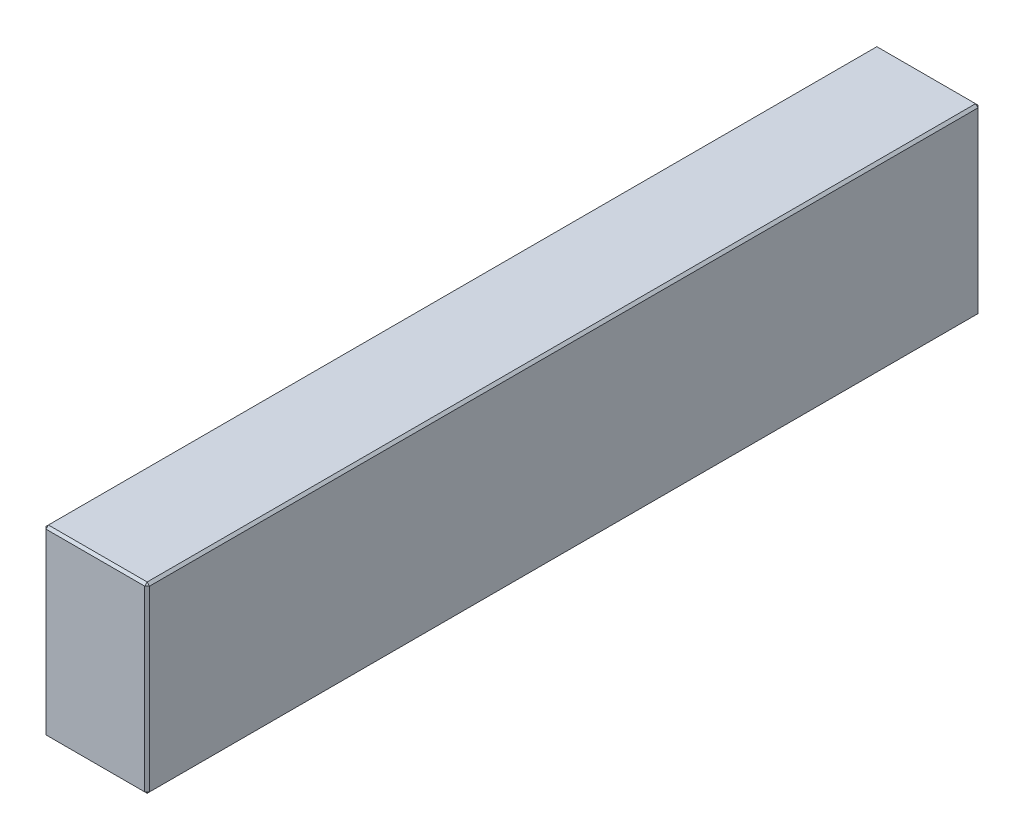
ISO-10303-21;
HEADER;
FILE_DESCRIPTION(('STEP AP214'),'2;1');
FILE_NAME('part.step','',(''),(''),'','','');
FILE_SCHEMA(('AUTOMOTIVE_DESIGN { 1 0 10303 214 1 1 1 1 }'));
ENDSEC;
DATA;
#1=APPLICATION_CONTEXT('core data for automotive mechanical design processes');
#2=APPLICATION_PROTOCOL_DEFINITION('international standard','automotive_design',2000,#1);
#3=PRODUCT_CONTEXT('',#1,'mechanical');
#4=PRODUCT('Part','Part','',(#3));
#5=PRODUCT_RELATED_PRODUCT_CATEGORY('part','',(#4));
#6=PRODUCT_DEFINITION_FORMATION('','',#4);
#7=PRODUCT_DEFINITION_CONTEXT('part definition',#1,'design');
#8=PRODUCT_DEFINITION('design','',#6,#7);
#9=PRODUCT_DEFINITION_SHAPE('','',#8);
#10=(LENGTH_UNIT() NAMED_UNIT(*) SI_UNIT(.MILLI.,.METRE.));
#11=(NAMED_UNIT(*) PLANE_ANGLE_UNIT() SI_UNIT($,.RADIAN.));
#12=(NAMED_UNIT(*) SI_UNIT($,.STERADIAN.) SOLID_ANGLE_UNIT());
#13=UNCERTAINTY_MEASURE_WITH_UNIT(LENGTH_MEASURE(1.E-05),#10,'distance_accuracy_value','');
#14=(GEOMETRIC_REPRESENTATION_CONTEXT(3) GLOBAL_UNCERTAINTY_ASSIGNED_CONTEXT((#13)) GLOBAL_UNIT_ASSIGNED_CONTEXT((#10,
#11,#12)) REPRESENTATION_CONTEXT('',''));
#15=CARTESIAN_POINT('',(0.,0.,0.));
#16=DIRECTION('',(0.,0.,1.));
#17=DIRECTION('',(1.,0.,0.));
#18=AXIS2_PLACEMENT_3D('',#15,#16,#17);
#19=CARTESIAN_POINT('',(-21.5,76.,173.));
#20=DIRECTION('',(1.,0.,0.));
#21=DIRECTION('',(0.,0.,-1.));
#22=AXIS2_PLACEMENT_3D('',#19,#20,#21);
#23=PLANE('',#22);
#24=DIRECTION('',(0.,-1.,0.));
#25=VECTOR('',#24,1.);
#26=CARTESIAN_POINT('',(-21.5,76.,-172.));
#27=LINE('',#26,#25);
#28=CARTESIAN_POINT('',(-21.5,75.,-172.));
#29=VERTEX_POINT('',#28);
#30=CARTESIAN_POINT('',(-21.5,1.00000000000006,-172.));
#31=VERTEX_POINT('',#30);
#32=EDGE_CURVE('E114',#29,#31,#27,.T.);
#33=ORIENTED_EDGE('',*,*,#32,.T.);
#34=DIRECTION('',(0.,0.,1.));
#35=VECTOR('',#34,1.);
#36=CARTESIAN_POINT('',(-21.5,1.00000000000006,173.));
#37=LINE('',#36,#35);
#38=CARTESIAN_POINT('',(-21.5,1.00000000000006,172.));
#39=VERTEX_POINT('',#38);
#40=EDGE_CURVE('E110',#31,#39,#37,.T.);
#41=ORIENTED_EDGE('',*,*,#40,.T.);
#42=DIRECTION('',(0.,1.,0.));
#43=VECTOR('',#42,1.);
#44=CARTESIAN_POINT('',(-21.5,76.,172.));
#45=LINE('',#44,#43);
#46=CARTESIAN_POINT('',(-21.5,75.,172.));
#47=VERTEX_POINT('',#46);
#48=EDGE_CURVE('E103',#39,#47,#45,.T.);
#49=ORIENTED_EDGE('',*,*,#48,.T.);
#50=DIRECTION('',(0.,0.,-1.));
#51=VECTOR('',#50,1.);
#52=CARTESIAN_POINT('',(-21.5,75.,-173.));
#53=LINE('',#52,#51);
#54=EDGE_CURVE('E107',#47,#29,#53,.T.);
#55=ORIENTED_EDGE('',*,*,#54,.T.);
#56=EDGE_LOOP('',(#33,#41,#49,#55));
#57=FACE_BOUND('',#56,.T.);
#58=ADVANCED_FACE('F15',(#57),#23,.F.);
#59=CARTESIAN_POINT('',(21.5,76.,173.));
#60=DIRECTION('',(0.,0.,-1.));
#61=DIRECTION('',(-1.,0.,0.));
#62=AXIS2_PLACEMENT_3D('',#59,#60,#61);
#63=PLANE('',#62);
#64=DIRECTION('',(-1.,0.,0.));
#65=VECTOR('',#64,1.);
#66=CARTESIAN_POINT('',(-21.5,75.,173.));
#67=LINE('',#66,#65);
#68=CARTESIAN_POINT('',(20.5,75.,173.));
#69=VERTEX_POINT('',#68);
#70=CARTESIAN_POINT('',(-20.5,75.,173.));
#71=VERTEX_POINT('',#70);
#72=EDGE_CURVE('E164',#69,#71,#67,.T.);
#73=ORIENTED_EDGE('',*,*,#72,.T.);
#74=DIRECTION('',(0.,-1.,0.));
#75=VECTOR('',#74,1.);
#76=CARTESIAN_POINT('',(-20.5,76.,173.));
#77=LINE('',#76,#75);
#78=CARTESIAN_POINT('',(-20.5,1.,173.));
#79=VERTEX_POINT('',#78);
#80=EDGE_CURVE('E122',#71,#79,#77,.T.);
#81=ORIENTED_EDGE('',*,*,#80,.T.);
#82=DIRECTION('',(1.,0.,0.));
#83=VECTOR('',#82,1.);
#84=CARTESIAN_POINT('',(21.5,1.,173.));
#85=LINE('',#84,#83);
#86=CARTESIAN_POINT('',(20.5,1.,173.));
#87=VERTEX_POINT('',#86);
#88=EDGE_CURVE('E168',#79,#87,#85,.T.);
#89=ORIENTED_EDGE('',*,*,#88,.T.);
#90=DIRECTION('',(0.,1.,0.));
#91=VECTOR('',#90,1.);
#92=CARTESIAN_POINT('',(20.5,76.,173.));
#93=LINE('',#92,#91);
#94=EDGE_CURVE('E166',#87,#69,#93,.T.);
#95=ORIENTED_EDGE('',*,*,#94,.T.);
#96=EDGE_LOOP('',(#73,#81,#89,#95));
#97=FACE_BOUND('',#96,.T.);
#98=ADVANCED_FACE('F275',(#97),#63,.F.);
#99=CARTESIAN_POINT('',(21.5,76.,173.));
#100=DIRECTION('',(-1.,0.,0.));
#101=DIRECTION('',(0.,0.,1.));
#102=AXIS2_PLACEMENT_3D('',#99,#100,#101);
#103=PLANE('',#102);
#104=DIRECTION('',(0.,0.,-1.));
#105=VECTOR('',#104,1.);
#106=CARTESIAN_POINT('',(21.5,1.,173.));
#107=LINE('',#106,#105);
#108=CARTESIAN_POINT('',(21.5,1.,172.));
#109=VERTEX_POINT('',#108);
#110=CARTESIAN_POINT('',(21.5,1.,-172.));
#111=VERTEX_POINT('',#110);
#112=EDGE_CURVE('E159',#109,#111,#107,.T.);
#113=ORIENTED_EDGE('',*,*,#112,.T.);
#114=DIRECTION('',(0.,1.,0.));
#115=VECTOR('',#114,1.);
#116=CARTESIAN_POINT('',(21.5,76.,-172.));
#117=LINE('',#116,#115);
#118=CARTESIAN_POINT('',(21.5,75.,-172.));
#119=VERTEX_POINT('',#118);
#120=EDGE_CURVE('E161',#111,#119,#117,.T.);
#121=ORIENTED_EDGE('',*,*,#120,.T.);
#122=DIRECTION('',(0.,0.,1.));
#123=VECTOR('',#122,1.);
#124=CARTESIAN_POINT('',(21.5,75.,173.));
#125=LINE('',#124,#123);
#126=CARTESIAN_POINT('',(21.5,75.,172.));
#127=VERTEX_POINT('',#126);
#128=EDGE_CURVE('E155',#119,#127,#125,.T.);
#129=ORIENTED_EDGE('',*,*,#128,.T.);
#130=DIRECTION('',(0.,-1.,0.));
#131=VECTOR('',#130,1.);
#132=CARTESIAN_POINT('',(21.5,76.,172.));
#133=LINE('',#132,#131);
#134=EDGE_CURVE('E157',#127,#109,#133,.T.);
#135=ORIENTED_EDGE('',*,*,#134,.T.);
#136=EDGE_LOOP('',(#113,#121,#129,#135));
#137=FACE_BOUND('',#136,.T.);
#138=ADVANCED_FACE('F254',(#137),#103,.F.);
#139=CARTESIAN_POINT('',(21.5,76.,-173.));
#140=DIRECTION('',(0.,0.,1.));
#141=DIRECTION('',(1.,0.,0.));
#142=AXIS2_PLACEMENT_3D('',#139,#140,#141);
#143=PLANE('',#142);
#144=DIRECTION('',(0.,-1.,0.));
#145=VECTOR('',#144,1.);
#146=CARTESIAN_POINT('',(20.5,76.,-173.));
#147=LINE('',#146,#145);
#148=CARTESIAN_POINT('',(20.5,75.,-173.));
#149=VERTEX_POINT('',#148);
#150=CARTESIAN_POINT('',(20.5,1.,-173.));
#151=VERTEX_POINT('',#150);
#152=EDGE_CURVE('E148',#149,#151,#147,.T.);
#153=ORIENTED_EDGE('',*,*,#152,.T.);
#154=DIRECTION('',(-1.,0.,0.));
#155=VECTOR('',#154,1.);
#156=CARTESIAN_POINT('',(21.5,1.,-173.));
#157=LINE('',#156,#155);
#158=CARTESIAN_POINT('',(-20.5,1.,-173.));
#159=VERTEX_POINT('',#158);
#160=EDGE_CURVE('E153',#151,#159,#157,.T.);
#161=ORIENTED_EDGE('',*,*,#160,.T.);
#162=DIRECTION('',(0.,1.,0.));
#163=VECTOR('',#162,1.);
#164=CARTESIAN_POINT('',(-20.5,76.,-173.));
#165=LINE('',#164,#163);
#166=CARTESIAN_POINT('',(-20.5,75.,-173.));
#167=VERTEX_POINT('',#166);
#168=EDGE_CURVE('E150',#159,#167,#165,.T.);
#169=ORIENTED_EDGE('',*,*,#168,.T.);
#170=DIRECTION('',(1.,0.,0.));
#171=VECTOR('',#170,1.);
#172=CARTESIAN_POINT('',(21.5,75.,-173.));
#173=LINE('',#172,#171);
#174=EDGE_CURVE('E146',#167,#149,#173,.T.);
#175=ORIENTED_EDGE('',*,*,#174,.T.);
#176=EDGE_LOOP('',(#153,#161,#169,#175));
#177=FACE_BOUND('',#176,.T.);
#178=ADVANCED_FACE('F284',(#177),#143,.F.);
#179=CARTESIAN_POINT('',(0.,76.,0.));
#180=DIRECTION('',(0.,1.,0.));
#181=DIRECTION('',(0.,0.,1.));
#182=AXIS2_PLACEMENT_3D('',#179,#180,#181);
#183=PLANE('',#182);
#184=DIRECTION('',(0.,0.,-1.));
#185=VECTOR('',#184,1.);
#186=CARTESIAN_POINT('',(20.5,76.,-173.));
#187=LINE('',#186,#185);
#188=CARTESIAN_POINT('',(20.5,76.,172.));
#189=VERTEX_POINT('',#188);
#190=CARTESIAN_POINT('',(20.5,76.,-172.));
#191=VERTEX_POINT('',#190);
#192=EDGE_CURVE('E24',#189,#191,#187,.T.);
#193=ORIENTED_EDGE('',*,*,#192,.T.);
#194=DIRECTION('',(-1.,0.,0.));
#195=VECTOR('',#194,1.);
#196=CARTESIAN_POINT('',(-21.5,76.,-172.));
#197=LINE('',#196,#195);
#198=CARTESIAN_POINT('',(-20.5,76.,-172.));
#199=VERTEX_POINT('',#198);
#200=EDGE_CURVE('E9',#191,#199,#197,.T.);
#201=ORIENTED_EDGE('',*,*,#200,.T.);
#202=DIRECTION('',(0.,0.,1.));
#203=VECTOR('',#202,1.);
#204=CARTESIAN_POINT('',(-20.5,76.,173.));
#205=LINE('',#204,#203);
#206=CARTESIAN_POINT('',(-20.5,76.,172.));
#207=VERTEX_POINT('',#206);
#208=EDGE_CURVE('E180',#199,#207,#205,.T.);
#209=ORIENTED_EDGE('',*,*,#208,.T.);
#210=DIRECTION('',(1.,0.,0.));
#211=VECTOR('',#210,1.);
#212=CARTESIAN_POINT('',(21.5,76.,172.));
#213=LINE('',#212,#211);
#214=EDGE_CURVE('E35',#207,#189,#213,.T.);
#215=ORIENTED_EDGE('',*,*,#214,.T.);
#216=EDGE_LOOP('',(#193,#201,#209,#215));
#217=FACE_BOUND('',#216,.T.);
#218=ADVANCED_FACE('F350',(#217),#183,.T.);
#219=CARTESIAN_POINT('',(0.,0.,0.));
#220=DIRECTION('',(0.,1.,0.));
#221=DIRECTION('',(0.,0.,1.));
#222=AXIS2_PLACEMENT_3D('',#219,#220,#221);
#223=PLANE('',#222);
#224=DIRECTION('',(0.,0.,1.));
#225=VECTOR('',#224,1.);
#226=CARTESIAN_POINT('',(20.5,0.,0.));
#227=LINE('',#226,#225);
#228=CARTESIAN_POINT('',(20.5,0.,-172.));
#229=VERTEX_POINT('',#228);
#230=CARTESIAN_POINT('',(20.5,0.,172.));
#231=VERTEX_POINT('',#230);
#232=EDGE_CURVE('E171',#229,#231,#227,.T.);
#233=ORIENTED_EDGE('',*,*,#232,.T.);
#234=DIRECTION('',(-1.,0.,0.));
#235=VECTOR('',#234,1.);
#236=CARTESIAN_POINT('',(0.,0.,172.));
#237=LINE('',#236,#235);
#238=CARTESIAN_POINT('',(-20.5,0.,172.));
#239=VERTEX_POINT('',#238);
#240=EDGE_CURVE('E177',#231,#239,#237,.T.);
#241=ORIENTED_EDGE('',*,*,#240,.T.);
#242=DIRECTION('',(0.,0.,-1.));
#243=VECTOR('',#242,1.);
#244=CARTESIAN_POINT('',(-20.5,0.,0.));
#245=LINE('',#244,#243);
#246=CARTESIAN_POINT('',(-20.5,0.,-172.));
#247=VERTEX_POINT('',#246);
#248=EDGE_CURVE('E175',#239,#247,#245,.T.);
#249=ORIENTED_EDGE('',*,*,#248,.T.);
#250=DIRECTION('',(1.,0.,0.));
#251=VECTOR('',#250,1.);
#252=CARTESIAN_POINT('',(0.,0.,-172.));
#253=LINE('',#252,#251);
#254=EDGE_CURVE('E173',#247,#229,#253,.T.);
#255=ORIENTED_EDGE('',*,*,#254,.T.);
#256=EDGE_LOOP('',(#233,#241,#249,#255));
#257=FACE_BOUND('',#256,.T.);
#258=ADVANCED_FACE('F246',(#257),#223,.F.);
#259=CARTESIAN_POINT('',(21.5,76.,172.));
#260=DIRECTION('',(-0.707106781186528,0.,-0.707106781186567));
#261=DIRECTION('',(0.,-1.,0.));
#262=AXIS2_PLACEMENT_3D('',#259,#260,#261);
#263=PLANE('',#262);
#264=DIRECTION('',(-0.707106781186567,0.,0.707106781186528));
#265=VECTOR('',#264,1.);
#266=CARTESIAN_POINT('',(20.5,75.,173.));
#267=LINE('',#266,#265);
#268=EDGE_CURVE('E19',#69,#127,#267,.F.);
#269=ORIENTED_EDGE('',*,*,#268,.F.);
#270=ORIENTED_EDGE('',*,*,#94,.F.);
#271=DIRECTION('',(0.707106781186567,0.,-0.707106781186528));
#272=VECTOR('',#271,1.);
#273=CARTESIAN_POINT('',(20.5,1.,173.));
#274=LINE('',#273,#272);
#275=EDGE_CURVE('E142',#109,#87,#274,.F.);
#276=ORIENTED_EDGE('',*,*,#275,.F.);
#277=ORIENTED_EDGE('',*,*,#134,.F.);
#278=EDGE_LOOP('',(#269,#270,#276,#277));
#279=FACE_BOUND('',#278,.T.);
#280=ADVANCED_FACE('F17',(#279),#263,.F.);
#281=CARTESIAN_POINT('',(20.5,75.,173.));
#282=DIRECTION('',(0.577350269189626,0.577350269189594,0.577350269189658));
#283=DIRECTION('',(0.707106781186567,0.,-0.707106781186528));
#284=AXIS2_PLACEMENT_3D('',#281,#282,#283);
#285=PLANE('',#284);
#286=DIRECTION('',(0.,-0.707106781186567,0.707106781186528));
#287=VECTOR('',#286,1.);
#288=CARTESIAN_POINT('',(20.5,75.,173.));
#289=LINE('',#288,#287);
#290=EDGE_CURVE('E226',#69,#189,#289,.F.);
#291=ORIENTED_EDGE('',*,*,#290,.F.);
#292=ORIENTED_EDGE('',*,*,#268,.T.);
#293=DIRECTION('',(-0.707106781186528,0.707106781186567,0.));
#294=VECTOR('',#293,1.);
#295=CARTESIAN_POINT('',(21.,75.5,172.));
#296=LINE('',#295,#294);
#297=EDGE_CURVE('E228',#189,#127,#296,.F.);
#298=ORIENTED_EDGE('',*,*,#297,.F.);
#299=EDGE_LOOP('',(#291,#292,#298));
#300=FACE_BOUND('',#299,.T.);
#301=ADVANCED_FACE('F270',(#300),#285,.T.);
#302=CARTESIAN_POINT('',(20.5,1.,173.));
#303=DIRECTION('',(0.577350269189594,-0.577350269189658,0.577350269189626));
#304=DIRECTION('',(0.,-0.707106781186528,-0.707106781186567));
#305=AXIS2_PLACEMENT_3D('',#302,#303,#304);
#306=PLANE('',#305);
#307=DIRECTION('',(-0.707106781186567,-0.707106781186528,0.));
#308=VECTOR('',#307,1.);
#309=CARTESIAN_POINT('',(21.,0.5,172.));
#310=LINE('',#309,#308);
#311=EDGE_CURVE('E220',#109,#231,#310,.T.);
#312=ORIENTED_EDGE('',*,*,#311,.F.);
#313=ORIENTED_EDGE('',*,*,#275,.T.);
#314=DIRECTION('',(0.,0.707106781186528,0.707106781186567));
#315=VECTOR('',#314,1.);
#316=CARTESIAN_POINT('',(20.5,1.,173.));
#317=LINE('',#316,#315);
#318=EDGE_CURVE('E223',#231,#87,#317,.T.);
#319=ORIENTED_EDGE('',*,*,#318,.F.);
#320=EDGE_LOOP('',(#312,#313,#319));
#321=FACE_BOUND('',#320,.T.);
#322=ADVANCED_FACE('F235',(#321),#306,.T.);
#323=CARTESIAN_POINT('',(20.5,76.,0.));
#324=DIRECTION('',(0.707106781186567,0.707106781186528,0.));
#325=DIRECTION('',(0.,0.,1.));
#326=AXIS2_PLACEMENT_3D('',#323,#324,#325);
#327=PLANE('',#326);
#328=ORIENTED_EDGE('',*,*,#297,.T.);
#329=ORIENTED_EDGE('',*,*,#128,.F.);
#330=DIRECTION('',(0.707106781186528,-0.707106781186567,0.));
#331=VECTOR('',#330,1.);
#332=CARTESIAN_POINT('',(21.5,75.,-172.));
#333=LINE('',#332,#331);
#334=EDGE_CURVE('E215',#191,#119,#333,.T.);
#335=ORIENTED_EDGE('',*,*,#334,.F.);
#336=ORIENTED_EDGE('',*,*,#192,.F.);
#337=EDGE_LOOP('',(#328,#329,#335,#336));
#338=FACE_BOUND('',#337,.T.);
#339=ADVANCED_FACE('F265',(#338),#327,.T.);
#340=CARTESIAN_POINT('',(0.,76.,172.));
#341=DIRECTION('',(0.,0.707106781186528,0.707106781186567));
#342=DIRECTION('',(-1.,0.,0.));
#343=AXIS2_PLACEMENT_3D('',#340,#341,#342);
#344=PLANE('',#343);
#345=ORIENTED_EDGE('',*,*,#290,.T.);
#346=ORIENTED_EDGE('',*,*,#214,.F.);
#347=DIRECTION('',(0.,0.707106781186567,-0.707106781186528));
#348=VECTOR('',#347,1.);
#349=CARTESIAN_POINT('',(-20.5,75.5,172.5));
#350=LINE('',#349,#348);
#351=EDGE_CURVE('E126',#71,#207,#350,.T.);
#352=ORIENTED_EDGE('',*,*,#351,.F.);
#353=ORIENTED_EDGE('',*,*,#72,.F.);
#354=EDGE_LOOP('',(#345,#346,#352,#353));
#355=FACE_BOUND('',#354,.T.);
#356=ADVANCED_FACE('F273',(#355),#344,.T.);
#357=CARTESIAN_POINT('',(-20.5,76.,173.));
#358=DIRECTION('',(0.707106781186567,0.,-0.707106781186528));
#359=DIRECTION('',(0.,-1.,0.));
#360=AXIS2_PLACEMENT_3D('',#357,#358,#359);
#361=PLANE('',#360);
#362=DIRECTION('',(0.707106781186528,0.,0.707106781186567));
#363=VECTOR('',#362,1.);
#364=CARTESIAN_POINT('',(-20.5,1.,173.));
#365=LINE('',#364,#363);
#366=EDGE_CURVE('E127',#79,#39,#365,.F.);
#367=ORIENTED_EDGE('',*,*,#366,.F.);
#368=ORIENTED_EDGE('',*,*,#80,.F.);
#369=DIRECTION('',(-0.707106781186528,0.,-0.707106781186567));
#370=VECTOR('',#369,1.);
#371=CARTESIAN_POINT('',(-21.5,75.,172.));
#372=LINE('',#371,#370);
#373=EDGE_CURVE('E118',#47,#71,#372,.F.);
#374=ORIENTED_EDGE('',*,*,#373,.F.);
#375=ORIENTED_EDGE('',*,*,#48,.F.);
#376=EDGE_LOOP('',(#367,#368,#374,#375));
#377=FACE_BOUND('',#376,.T.);
#378=ADVANCED_FACE('F120',(#377),#361,.F.);
#379=CARTESIAN_POINT('',(21.5,1.,173.));
#380=DIRECTION('',(0.,0.707106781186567,-0.707106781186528));
#381=DIRECTION('',(1.,0.,0.));
#382=AXIS2_PLACEMENT_3D('',#379,#380,#381);
#383=PLANE('',#382);
#384=ORIENTED_EDGE('',*,*,#318,.T.);
#385=ORIENTED_EDGE('',*,*,#88,.F.);
#386=DIRECTION('',(0.,-0.707106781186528,-0.707106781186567));
#387=VECTOR('',#386,1.);
#388=CARTESIAN_POINT('',(-20.5,1.,173.));
#389=LINE('',#388,#387);
#390=EDGE_CURVE('E211',#239,#79,#389,.F.);
#391=ORIENTED_EDGE('',*,*,#390,.F.);
#392=ORIENTED_EDGE('',*,*,#240,.F.);
#393=EDGE_LOOP('',(#384,#385,#391,#392));
#394=FACE_BOUND('',#393,.T.);
#395=ADVANCED_FACE('F243',(#394),#383,.F.);
#396=CARTESIAN_POINT('',(21.5,1.,173.));
#397=DIRECTION('',(-0.707106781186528,0.707106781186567,0.));
#398=DIRECTION('',(0.,0.,-1.));
#399=AXIS2_PLACEMENT_3D('',#396,#397,#398);
#400=PLANE('',#399);
#401=ORIENTED_EDGE('',*,*,#311,.T.);
#402=ORIENTED_EDGE('',*,*,#232,.F.);
#403=DIRECTION('',(0.707106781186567,0.707106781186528,0.));
#404=VECTOR('',#403,1.);
#405=CARTESIAN_POINT('',(21.,0.5,-172.));
#406=LINE('',#405,#404);
#407=EDGE_CURVE('E208',#111,#229,#406,.F.);
#408=ORIENTED_EDGE('',*,*,#407,.F.);
#409=ORIENTED_EDGE('',*,*,#112,.F.);
#410=EDGE_LOOP('',(#401,#402,#408,#409));
#411=FACE_BOUND('',#410,.T.);
#412=ADVANCED_FACE('F251',(#411),#400,.F.);
#413=CARTESIAN_POINT('',(20.5,76.,-173.));
#414=DIRECTION('',(-0.707106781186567,0.,0.707106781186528));
#415=DIRECTION('',(0.,-1.,0.));
#416=AXIS2_PLACEMENT_3D('',#413,#414,#415);
#417=PLANE('',#416);
#418=DIRECTION('',(0.707106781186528,0.,0.707106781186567));
#419=VECTOR('',#418,1.);
#420=CARTESIAN_POINT('',(21.5,75.,-172.));
#421=LINE('',#420,#419);
#422=EDGE_CURVE('E217',#119,#149,#421,.F.);
#423=ORIENTED_EDGE('',*,*,#422,.F.);
#424=ORIENTED_EDGE('',*,*,#120,.F.);
#425=DIRECTION('',(-0.707106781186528,0.,-0.707106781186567));
#426=VECTOR('',#425,1.);
#427=CARTESIAN_POINT('',(20.5,1.,-173.));
#428=LINE('',#427,#426);
#429=EDGE_CURVE('E205',#151,#111,#428,.F.);
#430=ORIENTED_EDGE('',*,*,#429,.F.);
#431=ORIENTED_EDGE('',*,*,#152,.F.);
#432=EDGE_LOOP('',(#423,#424,#430,#431));
#433=FACE_BOUND('',#432,.T.);
#434=ADVANCED_FACE('F258',(#433),#417,.F.);
#435=CARTESIAN_POINT('',(21.5,75.,-172.));
#436=DIRECTION('',(0.577350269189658,0.577350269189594,-0.577350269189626));
#437=DIRECTION('',(-0.707106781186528,0.,-0.707106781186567));
#438=AXIS2_PLACEMENT_3D('',#435,#436,#437);
#439=PLANE('',#438);
#440=ORIENTED_EDGE('',*,*,#334,.T.);
#441=ORIENTED_EDGE('',*,*,#422,.T.);
#442=DIRECTION('',(0.,0.707106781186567,0.707106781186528));
#443=VECTOR('',#442,1.);
#444=CARTESIAN_POINT('',(20.5,75.5,-172.5));
#445=LINE('',#444,#443);
#446=EDGE_CURVE('E134',#191,#149,#445,.F.);
#447=ORIENTED_EDGE('',*,*,#446,.F.);
#448=EDGE_LOOP('',(#440,#441,#447));
#449=FACE_BOUND('',#448,.T.);
#450=ADVANCED_FACE('F325',(#449),#439,.T.);
#451=CARTESIAN_POINT('',(-21.5,75.,172.));
#452=DIRECTION('',(-0.577350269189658,0.577350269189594,0.577350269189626));
#453=DIRECTION('',(0.707106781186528,0.,0.707106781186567));
#454=AXIS2_PLACEMENT_3D('',#451,#452,#453);
#455=PLANE('',#454);
#456=ORIENTED_EDGE('',*,*,#373,.T.);
#457=ORIENTED_EDGE('',*,*,#351,.T.);
#458=DIRECTION('',(-0.707106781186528,-0.707106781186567,0.));
#459=VECTOR('',#458,1.);
#460=CARTESIAN_POINT('',(-21.5,75.,172.));
#461=LINE('',#460,#459);
#462=EDGE_CURVE('E130',#47,#207,#461,.F.);
#463=ORIENTED_EDGE('',*,*,#462,.F.);
#464=EDGE_LOOP('',(#456,#457,#463));
#465=FACE_BOUND('',#464,.T.);
#466=ADVANCED_FACE('F131',(#465),#455,.T.);
#467=CARTESIAN_POINT('',(-20.5,1.,173.));
#468=DIRECTION('',(-0.577350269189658,-0.577350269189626,0.577350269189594));
#469=DIRECTION('',(0.707106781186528,-0.707106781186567,0.));
#470=AXIS2_PLACEMENT_3D('',#467,#468,#469);
#471=PLANE('',#470);
#472=ORIENTED_EDGE('',*,*,#390,.T.);
#473=ORIENTED_EDGE('',*,*,#366,.T.);
#474=DIRECTION('',(-0.707106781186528,0.707106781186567,0.));
#475=VECTOR('',#474,1.);
#476=CARTESIAN_POINT('',(-21.,0.500000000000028,172.));
#477=LINE('',#476,#475);
#478=EDGE_CURVE('E135',#239,#39,#477,.T.);
#479=ORIENTED_EDGE('',*,*,#478,.F.);
#480=EDGE_LOOP('',(#472,#473,#479));
#481=FACE_BOUND('',#480,.T.);
#482=ADVANCED_FACE('F318',(#481),#471,.T.);
#483=CARTESIAN_POINT('',(20.5,1.,-173.));
#484=DIRECTION('',(0.577350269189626,-0.577350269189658,-0.577350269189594));
#485=DIRECTION('',(0.707106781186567,0.707106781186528,0.));
#486=AXIS2_PLACEMENT_3D('',#483,#484,#485);
#487=PLANE('',#486);
#488=ORIENTED_EDGE('',*,*,#429,.T.);
#489=ORIENTED_EDGE('',*,*,#407,.T.);
#490=DIRECTION('',(0.,-0.707106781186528,0.707106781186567));
#491=VECTOR('',#490,1.);
#492=CARTESIAN_POINT('',(20.5,1.,-173.));
#493=LINE('',#492,#491);
#494=EDGE_CURVE('E198',#151,#229,#493,.T.);
#495=ORIENTED_EDGE('',*,*,#494,.F.);
#496=EDGE_LOOP('',(#488,#489,#495));
#497=FACE_BOUND('',#496,.T.);
#498=ADVANCED_FACE('F314',(#497),#487,.T.);
#499=CARTESIAN_POINT('',(0.,76.,-172.));
#500=DIRECTION('',(0.,0.707106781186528,-0.707106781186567));
#501=DIRECTION('',(1.,0.,0.));
#502=AXIS2_PLACEMENT_3D('',#499,#500,#501);
#503=PLANE('',#502);
#504=ORIENTED_EDGE('',*,*,#446,.T.);
#505=ORIENTED_EDGE('',*,*,#174,.F.);
#506=DIRECTION('',(0.,-0.707106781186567,-0.707106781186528));
#507=VECTOR('',#506,1.);
#508=CARTESIAN_POINT('',(-20.5,75.,-173.));
#509=LINE('',#508,#507);
#510=EDGE_CURVE('E195',#199,#167,#509,.T.);
#511=ORIENTED_EDGE('',*,*,#510,.F.);
#512=ORIENTED_EDGE('',*,*,#200,.F.);
#513=EDGE_LOOP('',(#504,#505,#511,#512));
#514=FACE_BOUND('',#513,.T.);
#515=ADVANCED_FACE('F311',(#514),#503,.T.);
#516=CARTESIAN_POINT('',(-20.5,76.,0.));
#517=DIRECTION('',(-0.707106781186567,0.707106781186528,0.));
#518=DIRECTION('',(0.,0.,-1.));
#519=AXIS2_PLACEMENT_3D('',#516,#517,#518);
#520=PLANE('',#519);
#521=ORIENTED_EDGE('',*,*,#462,.T.);
#522=ORIENTED_EDGE('',*,*,#208,.F.);
#523=DIRECTION('',(0.707106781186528,0.707106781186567,0.));
#524=VECTOR('',#523,1.);
#525=CARTESIAN_POINT('',(-21.,75.5,-172.));
#526=LINE('',#525,#524);
#527=EDGE_CURVE('E138',#29,#199,#526,.T.);
#528=ORIENTED_EDGE('',*,*,#527,.F.);
#529=ORIENTED_EDGE('',*,*,#54,.F.);
#530=EDGE_LOOP('',(#521,#522,#528,#529));
#531=FACE_BOUND('',#530,.T.);
#532=ADVANCED_FACE('F137',(#531),#520,.T.);
#533=CARTESIAN_POINT('',(-21.5,1.00000000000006,173.));
#534=DIRECTION('',(0.707106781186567,0.707106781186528,0.));
#535=DIRECTION('',(0.,0.,1.));
#536=AXIS2_PLACEMENT_3D('',#533,#534,#535);
#537=PLANE('',#536);
#538=ORIENTED_EDGE('',*,*,#478,.T.);
#539=ORIENTED_EDGE('',*,*,#40,.F.);
#540=DIRECTION('',(0.707106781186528,-0.707106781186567,0.));
#541=VECTOR('',#540,1.);
#542=CARTESIAN_POINT('',(-21.5,1.00000000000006,-172.));
#543=LINE('',#542,#541);
#544=EDGE_CURVE('E191',#247,#31,#543,.F.);
#545=ORIENTED_EDGE('',*,*,#544,.F.);
#546=ORIENTED_EDGE('',*,*,#248,.F.);
#547=EDGE_LOOP('',(#538,#539,#545,#546));
#548=FACE_BOUND('',#547,.T.);
#549=ADVANCED_FACE('F304',(#548),#537,.F.);
#550=CARTESIAN_POINT('',(21.5,1.,-173.));
#551=DIRECTION('',(0.,0.707106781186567,0.707106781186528));
#552=DIRECTION('',(-1.,0.,0.));
#553=AXIS2_PLACEMENT_3D('',#550,#551,#552);
#554=PLANE('',#553);
#555=ORIENTED_EDGE('',*,*,#494,.T.);
#556=ORIENTED_EDGE('',*,*,#254,.F.);
#557=DIRECTION('',(0.,0.707106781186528,-0.707106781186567));
#558=VECTOR('',#557,1.);
#559=CARTESIAN_POINT('',(-20.5,0.5,-172.5));
#560=LINE('',#559,#558);
#561=EDGE_CURVE('E188',#159,#247,#560,.F.);
#562=ORIENTED_EDGE('',*,*,#561,.F.);
#563=ORIENTED_EDGE('',*,*,#160,.F.);
#564=EDGE_LOOP('',(#555,#556,#562,#563));
#565=FACE_BOUND('',#564,.T.);
#566=ADVANCED_FACE('F300',(#565),#554,.F.);
#567=CARTESIAN_POINT('',(-20.5,75.,-173.));
#568=DIRECTION('',(-0.577350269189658,0.577350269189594,-0.577350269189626));
#569=DIRECTION('',(-0.707106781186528,0.,0.707106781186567));
#570=AXIS2_PLACEMENT_3D('',#567,#568,#569);
#571=PLANE('',#570);
#572=ORIENTED_EDGE('',*,*,#527,.T.);
#573=ORIENTED_EDGE('',*,*,#510,.T.);
#574=DIRECTION('',(0.707106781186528,0.,-0.707106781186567));
#575=VECTOR('',#574,1.);
#576=CARTESIAN_POINT('',(-20.5,75.,-173.));
#577=LINE('',#576,#575);
#578=EDGE_CURVE('E186',#29,#167,#577,.T.);
#579=ORIENTED_EDGE('',*,*,#578,.F.);
#580=EDGE_LOOP('',(#572,#573,#579));
#581=FACE_BOUND('',#580,.T.);
#582=ADVANCED_FACE('F296',(#581),#571,.T.);
#583=CARTESIAN_POINT('',(-21.5,1.00000000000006,-172.));
#584=DIRECTION('',(-0.577350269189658,-0.577350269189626,-0.577350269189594));
#585=DIRECTION('',(0.707106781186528,-0.707106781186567,0.));
#586=AXIS2_PLACEMENT_3D('',#583,#584,#585);
#587=PLANE('',#586);
#588=ORIENTED_EDGE('',*,*,#561,.T.);
#589=ORIENTED_EDGE('',*,*,#544,.T.);
#590=DIRECTION('',(-0.707106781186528,0.,0.707106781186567));
#591=VECTOR('',#590,1.);
#592=CARTESIAN_POINT('',(-21.5,1.00000000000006,-172.));
#593=LINE('',#592,#591);
#594=EDGE_CURVE('E184',#159,#31,#593,.T.);
#595=ORIENTED_EDGE('',*,*,#594,.F.);
#596=EDGE_LOOP('',(#588,#589,#595));
#597=FACE_BOUND('',#596,.T.);
#598=ADVANCED_FACE('F292',(#597),#587,.T.);
#599=CARTESIAN_POINT('',(-21.5,76.,-172.));
#600=DIRECTION('',(0.707106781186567,0.,0.707106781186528));
#601=DIRECTION('',(0.,-1.,0.));
#602=AXIS2_PLACEMENT_3D('',#599,#600,#601);
#603=PLANE('',#602);
#604=ORIENTED_EDGE('',*,*,#578,.T.);
#605=ORIENTED_EDGE('',*,*,#168,.F.);
#606=ORIENTED_EDGE('',*,*,#594,.T.);
#607=ORIENTED_EDGE('',*,*,#32,.F.);
#608=EDGE_LOOP('',(#604,#605,#606,#607));
#609=FACE_BOUND('',#608,.T.);
#610=ADVANCED_FACE('F289',(#609),#603,.F.);
#611=CLOSED_SHELL('',(#58,#98,#138,#178,#218,#258,#280,#301,#322,#339,#356,#378,#395,#412,#434,
#450,#466,#482,#498,#515,#532,#549,#566,#582,#598,#610));
#612=MANIFOLD_SOLID_BREP('B1',#611);
#613=ADVANCED_BREP_SHAPE_REPRESENTATION('',(#18,#612),#14);
#614=SHAPE_DEFINITION_REPRESENTATION(#9,#613);
ENDSEC;
END-ISO-10303-21;
